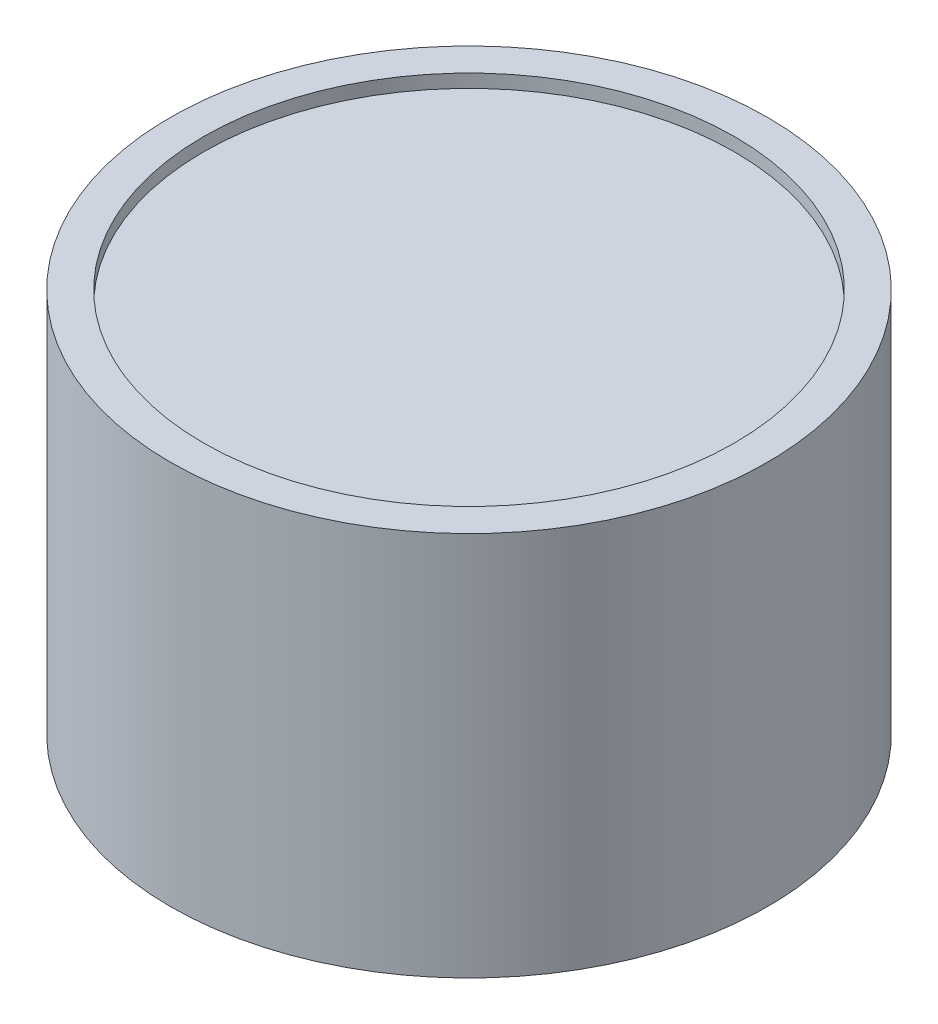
ISO-10303-21;
HEADER;
FILE_DESCRIPTION(('STEP AP214'),'2;1');
FILE_NAME('part.step','',(''),(''),'','','');
FILE_SCHEMA(('AUTOMOTIVE_DESIGN { 1 0 10303 214 1 1 1 1 }'));
ENDSEC;
DATA;
#1=APPLICATION_CONTEXT('core data for automotive mechanical design processes');
#2=APPLICATION_PROTOCOL_DEFINITION('international standard','automotive_design',2000,#1);
#3=PRODUCT_CONTEXT('',#1,'mechanical');
#4=PRODUCT('Part','Part','',(#3));
#5=PRODUCT_RELATED_PRODUCT_CATEGORY('part','',(#4));
#6=PRODUCT_DEFINITION_FORMATION('','',#4);
#7=PRODUCT_DEFINITION_CONTEXT('part definition',#1,'design');
#8=PRODUCT_DEFINITION('design','',#6,#7);
#9=PRODUCT_DEFINITION_SHAPE('','',#8);
#10=(LENGTH_UNIT() NAMED_UNIT(*) SI_UNIT(.MILLI.,.METRE.));
#11=(NAMED_UNIT(*) PLANE_ANGLE_UNIT() SI_UNIT($,.RADIAN.));
#12=(NAMED_UNIT(*) SI_UNIT($,.STERADIAN.) SOLID_ANGLE_UNIT());
#13=UNCERTAINTY_MEASURE_WITH_UNIT(LENGTH_MEASURE(1.E-05),#10,'distance_accuracy_value','');
#14=(GEOMETRIC_REPRESENTATION_CONTEXT(3) GLOBAL_UNCERTAINTY_ASSIGNED_CONTEXT((#13)) GLOBAL_UNIT_ASSIGNED_CONTEXT((#10,
#11,#12)) REPRESENTATION_CONTEXT('',''));
#15=CARTESIAN_POINT('',(0.,0.,0.));
#16=DIRECTION('',(0.,0.,1.));
#17=DIRECTION('',(1.,0.,0.));
#18=AXIS2_PLACEMENT_3D('',#15,#16,#17);
#19=CARTESIAN_POINT('',(0.,58.,0.));
#20=DIRECTION('',(0.,-1.,0.));
#21=DIRECTION('',(0.,0.,-1.));
#22=AXIS2_PLACEMENT_3D('',#19,#20,#21);
#23=CYLINDRICAL_SURFACE('',#22,45.);
#24=CARTESIAN_POINT('',(0.,58.,0.));
#25=DIRECTION('',(0.,1.,0.));
#26=DIRECTION('',(0.,0.,1.));
#27=AXIS2_PLACEMENT_3D('',#24,#25,#26);
#28=CIRCLE('',#27,45.);
#29=CARTESIAN_POINT('',(0.,58.,-45.));
#30=VERTEX_POINT('',#29);
#31=EDGE_CURVE('E10',#30,#30,#28,.T.);
#32=CARTESIAN_POINT('',(0.,0.,0.));
#33=DIRECTION('',(0.,1.,0.));
#34=DIRECTION('',(0.,0.,1.));
#35=AXIS2_PLACEMENT_3D('',#32,#33,#34);
#36=CIRCLE('',#35,45.);
#37=CARTESIAN_POINT('',(0.,0.,-45.));
#38=VERTEX_POINT('',#37);
#39=EDGE_CURVE('E40',#38,#38,#36,.T.);
#40=CARTESIAN_POINT('',(0.,58.,-45.));
#41=CARTESIAN_POINT('',(0.,57.3958333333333,-45.));
#42=CARTESIAN_POINT('',(0.,56.7916666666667,-45.));
#43=CARTESIAN_POINT('',(0.,55.5833333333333,-45.));
#44=CARTESIAN_POINT('',(0.,54.9791666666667,-45.));
#45=CARTESIAN_POINT('',(0.,53.7708333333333,-45.));
#46=CARTESIAN_POINT('',(0.,53.1666666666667,-45.));
#47=CARTESIAN_POINT('',(0.,51.9583333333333,-45.));
#48=CARTESIAN_POINT('',(0.,51.3541666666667,-45.));
#49=CARTESIAN_POINT('',(0.,50.1458333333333,-45.));
#50=CARTESIAN_POINT('',(0.,49.5416666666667,-45.));
#51=CARTESIAN_POINT('',(0.,48.3333333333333,-45.));
#52=CARTESIAN_POINT('',(0.,47.7291666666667,-45.));
#53=CARTESIAN_POINT('',(0.,46.5208333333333,-45.));
#54=CARTESIAN_POINT('',(0.,45.9166666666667,-45.));
#55=CARTESIAN_POINT('',(0.,44.7083333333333,-45.));
#56=CARTESIAN_POINT('',(0.,44.1041666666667,-45.));
#57=CARTESIAN_POINT('',(0.,42.8958333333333,-45.));
#58=CARTESIAN_POINT('',(0.,42.2916666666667,-45.));
#59=CARTESIAN_POINT('',(0.,41.0833333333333,-45.));
#60=CARTESIAN_POINT('',(0.,40.4791666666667,-45.));
#61=CARTESIAN_POINT('',(0.,39.2708333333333,-45.));
#62=CARTESIAN_POINT('',(0.,38.6666666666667,-45.));
#63=CARTESIAN_POINT('',(0.,37.4583333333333,-45.));
#64=CARTESIAN_POINT('',(0.,36.8541666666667,-45.));
#65=CARTESIAN_POINT('',(0.,35.6458333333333,-45.));
#66=CARTESIAN_POINT('',(0.,35.0416666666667,-45.));
#67=CARTESIAN_POINT('',(0.,33.8333333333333,-45.));
#68=CARTESIAN_POINT('',(0.,33.2291666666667,-45.));
#69=CARTESIAN_POINT('',(0.,32.0208333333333,-45.));
#70=CARTESIAN_POINT('',(0.,31.4166666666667,-45.));
#71=CARTESIAN_POINT('',(0.,30.2083333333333,-45.));
#72=CARTESIAN_POINT('',(0.,29.6041666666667,-45.));
#73=CARTESIAN_POINT('',(0.,28.3958333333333,-45.));
#74=CARTESIAN_POINT('',(0.,27.7916666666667,-45.));
#75=CARTESIAN_POINT('',(0.,26.5833333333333,-45.));
#76=CARTESIAN_POINT('',(0.,25.9791666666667,-45.));
#77=CARTESIAN_POINT('',(0.,24.7708333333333,-45.));
#78=CARTESIAN_POINT('',(0.,24.1666666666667,-45.));
#79=CARTESIAN_POINT('',(0.,22.9583333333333,-45.));
#80=CARTESIAN_POINT('',(0.,22.3541666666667,-45.));
#81=CARTESIAN_POINT('',(0.,21.1458333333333,-45.));
#82=CARTESIAN_POINT('',(0.,20.5416666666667,-45.));
#83=CARTESIAN_POINT('',(0.,19.3333333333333,-45.));
#84=CARTESIAN_POINT('',(0.,18.7291666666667,-45.));
#85=CARTESIAN_POINT('',(0.,17.5208333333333,-45.));
#86=CARTESIAN_POINT('',(0.,16.9166666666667,-45.));
#87=CARTESIAN_POINT('',(0.,15.7083333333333,-45.));
#88=CARTESIAN_POINT('',(0.,15.1041666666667,-45.));
#89=CARTESIAN_POINT('',(0.,13.8958333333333,-45.));
#90=CARTESIAN_POINT('',(0.,13.2916666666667,-45.));
#91=CARTESIAN_POINT('',(0.,12.0833333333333,-45.));
#92=CARTESIAN_POINT('',(0.,11.4791666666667,-45.));
#93=CARTESIAN_POINT('',(0.,10.2708333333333,-45.));
#94=CARTESIAN_POINT('',(0.,9.66666666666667,-45.));
#95=CARTESIAN_POINT('',(0.,8.45833333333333,-45.));
#96=CARTESIAN_POINT('',(0.,7.85416666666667,-45.));
#97=CARTESIAN_POINT('',(0.,6.64583333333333,-45.));
#98=CARTESIAN_POINT('',(0.,6.04166666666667,-45.));
#99=CARTESIAN_POINT('',(0.,4.83333333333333,-45.));
#100=CARTESIAN_POINT('',(0.,4.22916666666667,-45.));
#101=CARTESIAN_POINT('',(0.,3.02083333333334,-45.));
#102=CARTESIAN_POINT('',(0.,2.41666666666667,-45.));
#103=CARTESIAN_POINT('',(0.,1.20833333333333,-45.));
#104=CARTESIAN_POINT('',(0.,0.604166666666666,-45.));
#105=CARTESIAN_POINT('',(0.,0.,-45.));
#106=B_SPLINE_CURVE_WITH_KNOTS('',3,(#40,#41,#42,#43,#44,#45,#46,#47,#48,#49,#50,#51,#52,#53,
#54,#55,#56,#57,#58,#59,#60,#61,#62,#63,#64,#65,#66,#67,#68,#69,#70,#71,#72,#73,#74,#75,#76,#77,
#78,#79,#80,#81,#82,#83,#84,#85,#86,#87,#88,#89,#90,#91,#92,#93,#94,#95,#96,#97,#98,#99,#100,
#101,#102,#103,#104,#105),.UNSPECIFIED.,.F.,.F.,(4,2,2,2,2,2,2,2,2,2,2,2,2,2,2,2,2,2,2,2,2,2,2,
2,2,2,2,2,2,2,2,2,4),(0.,1.81249999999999,3.625,5.4375,7.24999999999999,9.06249999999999,10.875,
12.6875,14.5,16.3125,18.125,19.9375,21.75,23.5625,25.375,27.1875,29.,30.8125,32.625,34.4375,
36.25,38.0625,39.875,41.6875,43.5,45.3125,47.125,48.9375,50.75,52.5625,54.375,56.1875,58.),.UNSPECIFIED.);
#107=EDGE_CURVE('BSEAM37',#30,#38,#106,.T.);
#108=ORIENTED_EDGE('',*,*,#31,.F.);
#109=ORIENTED_EDGE('',*,*,#39,.T.);
#110=ORIENTED_EDGE('',*,*,#107,.T.);
#111=ORIENTED_EDGE('',*,*,#107,.F.);
#112=EDGE_LOOP('',(#108,#110,#109,#111));
#113=FACE_BOUND('',#112,.T.);
#114=ADVANCED_FACE('F37',(#113),#23,.T.);
#115=CARTESIAN_POINT('',(0.,58.,0.));
#116=DIRECTION('',(0.,1.,0.));
#117=DIRECTION('',(0.,0.,1.));
#118=AXIS2_PLACEMENT_3D('',#115,#116,#117);
#119=PLANE('',#118);
#120=CARTESIAN_POINT('',(0.,58.,0.));
#121=DIRECTION('',(0.,1.,0.));
#122=DIRECTION('',(0.,0.,1.));
#123=AXIS2_PLACEMENT_3D('',#120,#121,#122);
#124=CIRCLE('',#123,40.);
#125=CARTESIAN_POINT('',(0.,58.,40.));
#126=VERTEX_POINT('',#125);
#127=EDGE_CURVE('E51',#126,#126,#124,.T.);
#128=ORIENTED_EDGE('',*,*,#127,.F.);
#129=EDGE_LOOP('',(#128));
#130=FACE_BOUND('',#129,.T.);
#131=ORIENTED_EDGE('',*,*,#31,.T.);
#132=EDGE_LOOP('',(#131));
#133=FACE_BOUND('',#132,.T.);
#134=ADVANCED_FACE('F68',(#130,#133),#119,.T.);
#135=CARTESIAN_POINT('',(0.,0.,0.));
#136=DIRECTION('',(0.,1.,0.));
#137=DIRECTION('',(0.,0.,1.));
#138=AXIS2_PLACEMENT_3D('',#135,#136,#137);
#139=PLANE('',#138);
#140=ORIENTED_EDGE('',*,*,#39,.F.);
#141=EDGE_LOOP('',(#140));
#142=FACE_BOUND('',#141,.T.);
#143=ADVANCED_FACE('F64',(#142),#139,.F.);
#144=CARTESIAN_POINT('',(0.,56.,0.));
#145=DIRECTION('',(0.,1.,0.));
#146=DIRECTION('',(0.,0.,1.));
#147=AXIS2_PLACEMENT_3D('',#144,#145,#146);
#148=CYLINDRICAL_SURFACE('',#147,40.);
#149=CARTESIAN_POINT('',(0.,56.,0.));
#150=DIRECTION('',(0.,1.,0.));
#151=DIRECTION('',(0.,0.,1.));
#152=AXIS2_PLACEMENT_3D('',#149,#150,#151);
#153=CIRCLE('',#152,40.);
#154=CARTESIAN_POINT('',(0.,56.,40.));
#155=VERTEX_POINT('',#154);
#156=EDGE_CURVE('E49',#155,#155,#153,.T.);
#157=ORIENTED_EDGE('',*,*,#156,.F.);
#158=EDGE_LOOP('',(#157));
#159=FACE_BOUND('',#158,.T.);
#160=ORIENTED_EDGE('',*,*,#127,.T.);
#161=EDGE_LOOP('',(#160));
#162=FACE_BOUND('',#161,.T.);
#163=ADVANCED_FACE('F61',(#159,#162),#148,.F.);
#164=CARTESIAN_POINT('',(0.,56.,0.));
#165=DIRECTION('',(0.,1.,0.));
#166=DIRECTION('',(0.,0.,1.));
#167=AXIS2_PLACEMENT_3D('',#164,#165,#166);
#168=PLANE('',#167);
#169=ORIENTED_EDGE('',*,*,#156,.T.);
#170=EDGE_LOOP('',(#169));
#171=FACE_BOUND('',#170,.T.);
#172=ADVANCED_FACE('F59',(#171),#168,.T.);
#173=CLOSED_SHELL('',(#114,#134,#143,#163,#172));
#174=MANIFOLD_SOLID_BREP('B2',#173);
#175=ADVANCED_BREP_SHAPE_REPRESENTATION('',(#18,#174),#14);
#176=SHAPE_DEFINITION_REPRESENTATION(#9,#175);
ENDSEC;
END-ISO-10303-21;
